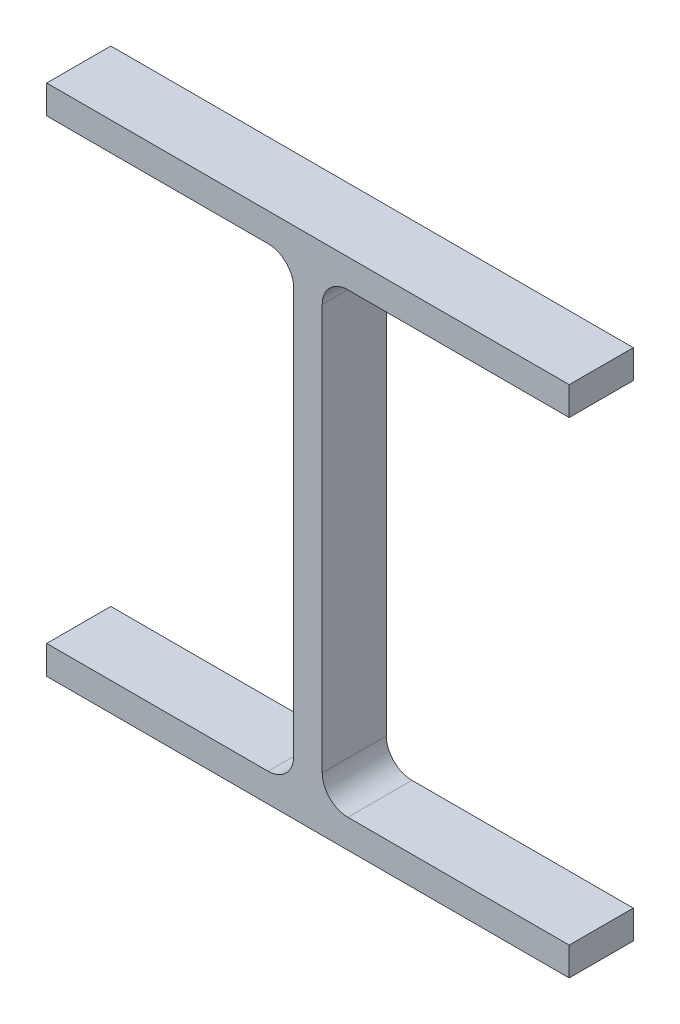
from build123d import *

# Parameters (mm, degrees)
BASESTEELHP_DEPTH = 12.7


with BuildPart() as part:
    # Sketch1 → BaseSteelHP (new, symmetric)
    with BuildSketch(Plane.XY):
        with BuildLine():
            Line((0, 0), (0, 11.303))
            Line((0, 11.303), (87.757, 11.303))
            ThreePointArc((87.757, 11.303), (94.941204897, 14.278795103), (97.917, 21.463))
            Line((97.917, 21.463), (97.917, 182.245))
            ThreePointArc((97.917, 182.245), (94.941204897, 189.429204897), (87.757, 192.405))
            Line((87.757, 192.405), (0, 192.405))
            Line((0, 192.405), (0, 203.708))
            Line((0, 203.708), (207.137, 203.708))
            Line((207.137, 203.708), (207.137, 192.405))
            Line((207.137, 192.405), (119.38, 192.405))
            ThreePointArc((119.38, 192.405), (112.195795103, 189.429204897), (109.22, 182.245))
            Line((109.22, 182.245), (109.22, 21.463))
            ThreePointArc((109.22, 21.463), (112.195795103, 14.278795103), (119.38, 11.303))
            Line((119.38, 11.303), (207.137, 11.303))
            Line((207.137, 11.303), (207.137, 0))
            Line((207.137, 0), (0, 0))
        make_face()
    extrude(amount=BASESTEELHP_DEPTH, both=True)


solid = part.part
